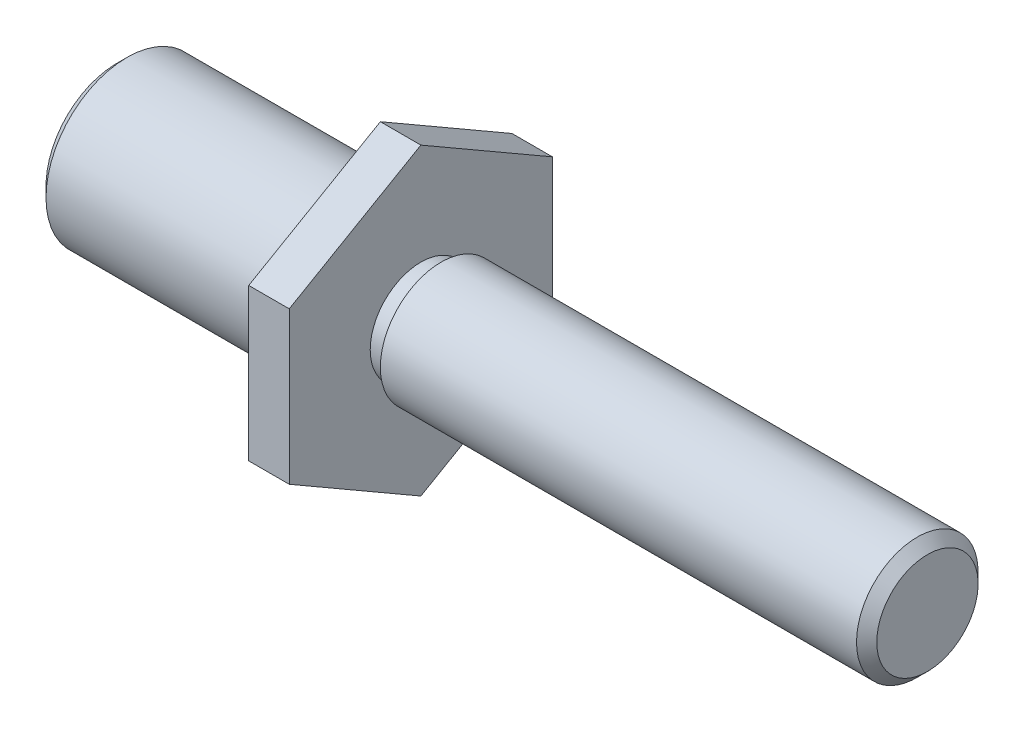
ISO-10303-21;
HEADER;
FILE_DESCRIPTION(('STEP AP214'),'2;1');
FILE_NAME('part.step','',(''),(''),'','','');
FILE_SCHEMA(('AUTOMOTIVE_DESIGN { 1 0 10303 214 1 1 1 1 }'));
ENDSEC;
DATA;
#1=APPLICATION_CONTEXT('core data for automotive mechanical design processes');
#2=APPLICATION_PROTOCOL_DEFINITION('international standard','automotive_design',2000,#1);
#3=PRODUCT_CONTEXT('',#1,'mechanical');
#4=PRODUCT('Part','Part','',(#3));
#5=PRODUCT_RELATED_PRODUCT_CATEGORY('part','',(#4));
#6=PRODUCT_DEFINITION_FORMATION('','',#4);
#7=PRODUCT_DEFINITION_CONTEXT('part definition',#1,'design');
#8=PRODUCT_DEFINITION('design','',#6,#7);
#9=PRODUCT_DEFINITION_SHAPE('','',#8);
#10=(LENGTH_UNIT() NAMED_UNIT(*) SI_UNIT(.MILLI.,.METRE.));
#11=(NAMED_UNIT(*) PLANE_ANGLE_UNIT() SI_UNIT($,.RADIAN.));
#12=(NAMED_UNIT(*) SI_UNIT($,.STERADIAN.) SOLID_ANGLE_UNIT());
#13=UNCERTAINTY_MEASURE_WITH_UNIT(LENGTH_MEASURE(1.E-05),#10,'distance_accuracy_value','');
#14=(GEOMETRIC_REPRESENTATION_CONTEXT(3) GLOBAL_UNCERTAINTY_ASSIGNED_CONTEXT((#13)) GLOBAL_UNIT_ASSIGNED_CONTEXT((#10,
#11,#12)) REPRESENTATION_CONTEXT('',''));
#15=CARTESIAN_POINT('',(0.,0.,0.));
#16=DIRECTION('',(0.,0.,1.));
#17=DIRECTION('',(1.,0.,0.));
#18=AXIS2_PLACEMENT_3D('',#15,#16,#17);
#19=CARTESIAN_POINT('',(0.,0.,0.));
#20=DIRECTION('',(1.,0.,0.));
#21=DIRECTION('',(0.,0.,-1.));
#22=AXIS2_PLACEMENT_3D('',#19,#20,#21);
#23=PLANE('',#22);
#24=CARTESIAN_POINT('',(0.,0.,0.));
#25=DIRECTION('',(1.,0.,0.));
#26=DIRECTION('',(0.,0.,-1.));
#27=AXIS2_PLACEMENT_3D('',#24,#25,#26);
#28=CIRCLE('',#27,3.49999999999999);
#29=CARTESIAN_POINT('',(0.,0.,-3.49999999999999));
#30=VERTEX_POINT('',#29);
#31=EDGE_CURVE('E163',#30,#30,#28,.F.);
#32=ORIENTED_EDGE('',*,*,#31,.T.);
#33=EDGE_LOOP('',(#32));
#34=FACE_BOUND('',#33,.T.);
#35=ADVANCED_FACE('F38',(#34),#23,.F.);
#36=CARTESIAN_POINT('',(0.,0.,0.));
#37=DIRECTION('',(-1.,0.,0.));
#38=DIRECTION('',(0.,0.,1.));
#39=AXIS2_PLACEMENT_3D('',#36,#37,#38);
#40=CYLINDRICAL_SURFACE('',#39,4.);
#41=CARTESIAN_POINT('',(0.500000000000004,0.,0.));
#42=DIRECTION('',(1.,0.,0.));
#43=DIRECTION('',(0.,0.,-1.));
#44=AXIS2_PLACEMENT_3D('',#41,#42,#43);
#45=CIRCLE('',#44,4.);
#46=CARTESIAN_POINT('',(0.500000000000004,0.,-4.));
#47=VERTEX_POINT('',#46);
#48=EDGE_CURVE('E166',#47,#47,#45,.T.);
#49=ORIENTED_EDGE('',*,*,#48,.T.);
#50=EDGE_LOOP('',(#49));
#51=FACE_BOUND('',#50,.T.);
#52=CARTESIAN_POINT('',(12.,0.,0.));
#53=DIRECTION('',(-1.,0.,0.));
#54=DIRECTION('',(0.,0.,1.));
#55=AXIS2_PLACEMENT_3D('',#52,#53,#54);
#56=CIRCLE('',#55,4.);
#57=CARTESIAN_POINT('',(12.,0.,4.));
#58=VERTEX_POINT('',#57);
#59=EDGE_CURVE('E160',#58,#58,#56,.T.);
#60=ORIENTED_EDGE('',*,*,#59,.T.);
#61=EDGE_LOOP('',(#60));
#62=FACE_BOUND('',#61,.T.);
#63=ADVANCED_FACE('F198',(#51,#62),#40,.T.);
#64=CARTESIAN_POINT('',(12.,4.,0.));
#65=DIRECTION('',(-1.,0.,0.));
#66=DIRECTION('',(0.,0.,1.));
#67=AXIS2_PLACEMENT_3D('',#64,#65,#66);
#68=PLANE('',#67);
#69=ORIENTED_EDGE('',*,*,#59,.F.);
#70=EDGE_LOOP('',(#69));
#71=FACE_BOUND('',#70,.T.);
#72=CARTESIAN_POINT('',(12.,0.,0.));
#73=DIRECTION('',(-1.,0.,0.));
#74=DIRECTION('',(0.,0.,1.));
#75=AXIS2_PLACEMENT_3D('',#72,#73,#74);
#76=CIRCLE('',#75,3.5);
#77=CARTESIAN_POINT('',(12.,0.,3.5));
#78=VERTEX_POINT('',#77);
#79=EDGE_CURVE('E157',#78,#78,#76,.T.);
#80=ORIENTED_EDGE('',*,*,#79,.T.);
#81=EDGE_LOOP('',(#80));
#82=FACE_BOUND('',#81,.T.);
#83=ADVANCED_FACE('F204',(#71,#82),#68,.F.);
#84=CARTESIAN_POINT('',(0.,0.,0.));
#85=DIRECTION('',(-1.,0.,0.));
#86=DIRECTION('',(0.,0.,1.));
#87=AXIS2_PLACEMENT_3D('',#84,#85,#86);
#88=CYLINDRICAL_SURFACE('',#87,3.5);
#89=ORIENTED_EDGE('',*,*,#79,.F.);
#90=EDGE_LOOP('',(#89));
#91=FACE_BOUND('',#90,.T.);
#92=CARTESIAN_POINT('',(13.,0.,0.));
#93=DIRECTION('',(-1.,0.,0.));
#94=DIRECTION('',(0.,0.,1.));
#95=AXIS2_PLACEMENT_3D('',#92,#93,#94);
#96=CIRCLE('',#95,3.5);
#97=CARTESIAN_POINT('',(13.,0.,3.5));
#98=VERTEX_POINT('',#97);
#99=EDGE_CURVE('E154',#98,#98,#96,.T.);
#100=ORIENTED_EDGE('',*,*,#99,.T.);
#101=EDGE_LOOP('',(#100));
#102=FACE_BOUND('',#101,.T.);
#103=ADVANCED_FACE('F217',(#91,#102),#88,.T.);
#104=CARTESIAN_POINT('',(13.,3.5,0.));
#105=DIRECTION('',(1.,0.,0.));
#106=DIRECTION('',(0.,0.,-1.));
#107=AXIS2_PLACEMENT_3D('',#104,#105,#106);
#108=PLANE('',#107);
#109=ORIENTED_EDGE('',*,*,#99,.F.);
#110=EDGE_LOOP('',(#109));
#111=FACE_BOUND('',#110,.T.);
#112=DIRECTION('',(0.,1.,0.));
#113=VECTOR('',#112,1.);
#114=CARTESIAN_POINT('',(13.,3.5,6.49519052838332));
#115=LINE('',#114,#113);
#116=CARTESIAN_POINT('',(13.,-3.74999999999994,6.49519052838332));
#117=VERTEX_POINT('',#116);
#118=CARTESIAN_POINT('',(13.,3.74999999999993,6.49519052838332));
#119=VERTEX_POINT('',#118);
#120=EDGE_CURVE('E142',#117,#119,#115,.T.);
#121=ORIENTED_EDGE('',*,*,#120,.T.);
#122=DIRECTION('',(0.,0.500000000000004,-0.866025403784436));
#123=VECTOR('',#122,1.);
#124=CARTESIAN_POINT('',(13.,6.49999999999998,1.73205080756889));
#125=LINE('',#124,#123);
#126=CARTESIAN_POINT('',(13.,7.5,0.));
#127=VERTEX_POINT('',#126);
#128=EDGE_CURVE('E127',#119,#127,#125,.T.);
#129=ORIENTED_EDGE('',*,*,#128,.T.);
#130=DIRECTION('',(0.,-0.500000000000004,-0.866025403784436));
#131=VECTOR('',#130,1.);
#132=CARTESIAN_POINT('',(13.,6.49999999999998,-1.73205080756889));
#133=LINE('',#132,#131);
#134=CARTESIAN_POINT('',(13.,3.74999999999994,-6.49519052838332));
#135=VERTEX_POINT('',#134);
#136=EDGE_CURVE('E128',#127,#135,#133,.T.);
#137=ORIENTED_EDGE('',*,*,#136,.T.);
#138=DIRECTION('',(0.,-1.,0.));
#139=VECTOR('',#138,1.);
#140=CARTESIAN_POINT('',(13.,3.5,-6.49519052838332));
#141=LINE('',#140,#139);
#142=CARTESIAN_POINT('',(13.,-3.74999999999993,-6.49519052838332));
#143=VERTEX_POINT('',#142);
#144=EDGE_CURVE('E100',#135,#143,#141,.T.);
#145=ORIENTED_EDGE('',*,*,#144,.T.);
#146=DIRECTION('',(0.,-0.500000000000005,0.866025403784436));
#147=VECTOR('',#146,1.);
#148=CARTESIAN_POINT('',(13.,-4.74999999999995,-4.76313972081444));
#149=LINE('',#148,#147);
#150=CARTESIAN_POINT('',(13.,-7.5,0.));
#151=VERTEX_POINT('',#150);
#152=EDGE_CURVE('E136',#143,#151,#149,.T.);
#153=ORIENTED_EDGE('',*,*,#152,.T.);
#154=DIRECTION('',(0.,0.500000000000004,0.866025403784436));
#155=VECTOR('',#154,1.);
#156=CARTESIAN_POINT('',(13.,-4.74999999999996,4.76313972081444));
#157=LINE('',#156,#155);
#158=EDGE_CURVE('E139',#151,#117,#157,.T.);
#159=ORIENTED_EDGE('',*,*,#158,.T.);
#160=EDGE_LOOP('',(#121,#129,#137,#145,#153,#159));
#161=FACE_BOUND('',#160,.T.);
#162=ADVANCED_FACE('F210',(#111,#161),#108,.F.);
#163=CARTESIAN_POINT('',(0.,0.,0.));
#164=DIRECTION('',(1.,0.,0.));
#165=DIRECTION('',(0.,0.,-1.));
#166=AXIS2_PLACEMENT_3D('',#163,#164,#165);
#167=CONICAL_SURFACE('',#166,3.49999999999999,0.785398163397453);
#168=ORIENTED_EDGE('',*,*,#48,.F.);
#169=EDGE_LOOP('',(#168));
#170=FACE_BOUND('',#169,.T.);
#171=ORIENTED_EDGE('',*,*,#31,.F.);
#172=EDGE_LOOP('',(#171));
#173=FACE_BOUND('',#172,.T.);
#174=ADVANCED_FACE('F208',(#170,#173),#167,.T.);
#175=CARTESIAN_POINT('',(40.,7.5,0.));
#176=DIRECTION('',(0.,-0.866025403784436,-0.500000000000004));
#177=DIRECTION('',(0.,0.500000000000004,-0.866025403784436));
#178=AXIS2_PLACEMENT_3D('',#175,#176,#177);
#179=PLANE('',#178);
#180=DIRECTION('',(-1.,0.,0.));
#181=VECTOR('',#180,1.);
#182=CARTESIAN_POINT('',(40.,3.74999999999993,6.49519052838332));
#183=LINE('',#182,#181);
#184=CARTESIAN_POINT('',(15.,3.74999999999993,6.49519052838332));
#185=VERTEX_POINT('',#184);
#186=EDGE_CURVE('E120',#185,#119,#183,.T.);
#187=ORIENTED_EDGE('',*,*,#186,.F.);
#188=DIRECTION('',(0.,-0.500000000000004,0.866025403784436));
#189=VECTOR('',#188,1.);
#190=CARTESIAN_POINT('',(15.,7.5,0.));
#191=LINE('',#190,#189);
#192=CARTESIAN_POINT('',(15.,7.5,0.));
#193=VERTEX_POINT('',#192);
#194=EDGE_CURVE('E12',#193,#185,#191,.T.);
#195=ORIENTED_EDGE('',*,*,#194,.F.);
#196=DIRECTION('',(-1.,0.,0.));
#197=VECTOR('',#196,1.);
#198=CARTESIAN_POINT('',(40.,7.5,0.));
#199=LINE('',#198,#197);
#200=EDGE_CURVE('E58',#193,#127,#199,.T.);
#201=ORIENTED_EDGE('',*,*,#200,.T.);
#202=ORIENTED_EDGE('',*,*,#128,.F.);
#203=EDGE_LOOP('',(#187,#195,#201,#202));
#204=FACE_BOUND('',#203,.T.);
#205=ADVANCED_FACE('F125',(#204),#179,.F.);
#206=CARTESIAN_POINT('',(40.,3.74999999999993,6.49519052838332));
#207=DIRECTION('',(0.,0.,-1.));
#208=DIRECTION('',(0.,1.,0.));
#209=AXIS2_PLACEMENT_3D('',#206,#207,#208);
#210=PLANE('',#209);
#211=DIRECTION('',(-1.,0.,0.));
#212=VECTOR('',#211,1.);
#213=CARTESIAN_POINT('',(40.,-3.74999999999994,6.49519052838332));
#214=LINE('',#213,#212);
#215=CARTESIAN_POINT('',(15.,-3.74999999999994,6.49519052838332));
#216=VERTEX_POINT('',#215);
#217=EDGE_CURVE('E123',#216,#117,#214,.T.);
#218=ORIENTED_EDGE('',*,*,#217,.F.);
#219=DIRECTION('',(0.,-1.,0.));
#220=VECTOR('',#219,1.);
#221=CARTESIAN_POINT('',(15.,7.5,6.49519052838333));
#222=LINE('',#221,#220);
#223=EDGE_CURVE('E46',#185,#216,#222,.T.);
#224=ORIENTED_EDGE('',*,*,#223,.F.);
#225=ORIENTED_EDGE('',*,*,#186,.T.);
#226=ORIENTED_EDGE('',*,*,#120,.F.);
#227=EDGE_LOOP('',(#218,#224,#225,#226));
#228=FACE_BOUND('',#227,.T.);
#229=ADVANCED_FACE('F119',(#228),#210,.F.);
#230=CARTESIAN_POINT('',(40.,-3.74999999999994,6.49519052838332));
#231=DIRECTION('',(0.,0.866025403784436,-0.500000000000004));
#232=DIRECTION('',(0.,0.500000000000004,0.866025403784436));
#233=AXIS2_PLACEMENT_3D('',#230,#231,#232);
#234=PLANE('',#233);
#235=DIRECTION('',(-1.,0.,0.));
#236=VECTOR('',#235,1.);
#237=CARTESIAN_POINT('',(40.,-7.5,0.));
#238=LINE('',#237,#236);
#239=CARTESIAN_POINT('',(15.,-7.5,0.));
#240=VERTEX_POINT('',#239);
#241=EDGE_CURVE('E131',#240,#151,#238,.T.);
#242=ORIENTED_EDGE('',*,*,#241,.F.);
#243=DIRECTION('',(0.,-0.500000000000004,-0.866025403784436));
#244=VECTOR('',#243,1.);
#245=CARTESIAN_POINT('',(15.,-3.74999999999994,6.49519052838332));
#246=LINE('',#245,#244);
#247=EDGE_CURVE('E110',#216,#240,#246,.T.);
#248=ORIENTED_EDGE('',*,*,#247,.F.);
#249=ORIENTED_EDGE('',*,*,#217,.T.);
#250=ORIENTED_EDGE('',*,*,#158,.F.);
#251=EDGE_LOOP('',(#242,#248,#249,#250));
#252=FACE_BOUND('',#251,.T.);
#253=ADVANCED_FACE('F237',(#252),#234,.F.);
#254=CARTESIAN_POINT('',(40.,-7.5,0.));
#255=DIRECTION('',(0.,0.866025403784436,0.500000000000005));
#256=DIRECTION('',(0.,-0.500000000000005,0.866025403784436));
#257=AXIS2_PLACEMENT_3D('',#254,#255,#256);
#258=PLANE('',#257);
#259=DIRECTION('',(-1.,0.,0.));
#260=VECTOR('',#259,1.);
#261=CARTESIAN_POINT('',(40.,-3.74999999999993,-6.49519052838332));
#262=LINE('',#261,#260);
#263=CARTESIAN_POINT('',(15.,-3.74999999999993,-6.49519052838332));
#264=VERTEX_POINT('',#263);
#265=EDGE_CURVE('E102',#264,#143,#262,.T.);
#266=ORIENTED_EDGE('',*,*,#265,.F.);
#267=DIRECTION('',(0.,0.500000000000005,-0.866025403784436));
#268=VECTOR('',#267,1.);
#269=CARTESIAN_POINT('',(15.,-3.74999999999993,-6.49519052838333));
#270=LINE('',#269,#268);
#271=EDGE_CURVE('E108',#240,#264,#270,.T.);
#272=ORIENTED_EDGE('',*,*,#271,.F.);
#273=ORIENTED_EDGE('',*,*,#241,.T.);
#274=ORIENTED_EDGE('',*,*,#152,.F.);
#275=EDGE_LOOP('',(#266,#272,#273,#274));
#276=FACE_BOUND('',#275,.T.);
#277=ADVANCED_FACE('F242',(#276),#258,.F.);
#278=CARTESIAN_POINT('',(40.,-3.74999999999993,-6.49519052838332));
#279=DIRECTION('',(0.,0.,1.));
#280=DIRECTION('',(0.,-1.,0.));
#281=AXIS2_PLACEMENT_3D('',#278,#279,#280);
#282=PLANE('',#281);
#283=DIRECTION('',(-1.,0.,0.));
#284=VECTOR('',#283,1.);
#285=CARTESIAN_POINT('',(40.,3.74999999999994,-6.49519052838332));
#286=LINE('',#285,#284);
#287=CARTESIAN_POINT('',(15.,3.74999999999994,-6.49519052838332));
#288=VERTEX_POINT('',#287);
#289=EDGE_CURVE('E53',#288,#135,#286,.T.);
#290=ORIENTED_EDGE('',*,*,#289,.F.);
#291=DIRECTION('',(0.,1.,0.));
#292=VECTOR('',#291,1.);
#293=CARTESIAN_POINT('',(15.,7.5,-6.49519052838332));
#294=LINE('',#293,#292);
#295=EDGE_CURVE('E92',#264,#288,#294,.T.);
#296=ORIENTED_EDGE('',*,*,#295,.F.);
#297=ORIENTED_EDGE('',*,*,#265,.T.);
#298=ORIENTED_EDGE('',*,*,#144,.F.);
#299=EDGE_LOOP('',(#290,#296,#297,#298));
#300=FACE_BOUND('',#299,.T.);
#301=ADVANCED_FACE('F96',(#300),#282,.F.);
#302=CARTESIAN_POINT('',(40.,3.74999999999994,-6.49519052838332));
#303=DIRECTION('',(0.,-0.866025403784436,0.500000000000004));
#304=DIRECTION('',(0.,-0.500000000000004,-0.866025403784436));
#305=AXIS2_PLACEMENT_3D('',#302,#303,#304);
#306=PLANE('',#305);
#307=ORIENTED_EDGE('',*,*,#200,.F.);
#308=DIRECTION('',(0.,0.500000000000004,0.866025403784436));
#309=VECTOR('',#308,1.);
#310=CARTESIAN_POINT('',(15.,7.5,0.));
#311=LINE('',#310,#309);
#312=EDGE_CURVE('E88',#288,#193,#311,.T.);
#313=ORIENTED_EDGE('',*,*,#312,.F.);
#314=ORIENTED_EDGE('',*,*,#289,.T.);
#315=ORIENTED_EDGE('',*,*,#136,.F.);
#316=EDGE_LOOP('',(#307,#313,#314,#315));
#317=FACE_BOUND('',#316,.T.);
#318=ADVANCED_FACE('F89',(#317),#306,.F.);
#319=CARTESIAN_POINT('',(40.,3.,0.));
#320=DIRECTION('',(-1.,0.,0.));
#321=DIRECTION('',(0.,0.,1.));
#322=AXIS2_PLACEMENT_3D('',#319,#320,#321);
#323=PLANE('',#322);
#324=CARTESIAN_POINT('',(40.,0.,0.));
#325=DIRECTION('',(-1.,0.,0.));
#326=DIRECTION('',(0.,0.,1.));
#327=AXIS2_PLACEMENT_3D('',#324,#325,#326);
#328=CIRCLE('',#327,2.5);
#329=CARTESIAN_POINT('',(40.,0.,2.5));
#330=VERTEX_POINT('',#329);
#331=EDGE_CURVE('E93',#330,#330,#328,.F.);
#332=ORIENTED_EDGE('',*,*,#331,.T.);
#333=EDGE_LOOP('',(#332));
#334=FACE_BOUND('',#333,.T.);
#335=ADVANCED_FACE('F174',(#334),#323,.F.);
#336=CARTESIAN_POINT('',(39.5,0.,0.));
#337=DIRECTION('',(-1.,0.,0.));
#338=DIRECTION('',(0.,0.,1.));
#339=AXIS2_PLACEMENT_3D('',#336,#337,#338);
#340=CONICAL_SURFACE('',#339,3.,0.785398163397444);
#341=ORIENTED_EDGE('',*,*,#331,.F.);
#342=EDGE_LOOP('',(#341));
#343=FACE_BOUND('',#342,.T.);
#344=CARTESIAN_POINT('',(39.5,0.,0.));
#345=DIRECTION('',(-1.,0.,0.));
#346=DIRECTION('',(0.,0.,1.));
#347=AXIS2_PLACEMENT_3D('',#344,#345,#346);
#348=CIRCLE('',#347,3.);
#349=CARTESIAN_POINT('',(39.5,0.,3.));
#350=VERTEX_POINT('',#349);
#351=EDGE_CURVE('E169',#350,#350,#348,.T.);
#352=ORIENTED_EDGE('',*,*,#351,.F.);
#353=EDGE_LOOP('',(#352));
#354=FACE_BOUND('',#353,.T.);
#355=ADVANCED_FACE('F40',(#343,#354),#340,.T.);
#356=CARTESIAN_POINT('',(0.,0.,0.));
#357=DIRECTION('',(-1.,0.,0.));
#358=DIRECTION('',(0.,0.,1.));
#359=AXIS2_PLACEMENT_3D('',#356,#357,#358);
#360=CYLINDRICAL_SURFACE('',#359,3.);
#361=ORIENTED_EDGE('',*,*,#351,.T.);
#362=EDGE_LOOP('',(#361));
#363=FACE_BOUND('',#362,.T.);
#364=CARTESIAN_POINT('',(16.,0.,0.));
#365=DIRECTION('',(-1.,0.,0.));
#366=DIRECTION('',(0.,0.,1.));
#367=AXIS2_PLACEMENT_3D('',#364,#365,#366);
#368=CIRCLE('',#367,3.);
#369=CARTESIAN_POINT('',(16.,0.,3.));
#370=VERTEX_POINT('',#369);
#371=EDGE_CURVE('E145',#370,#370,#368,.T.);
#372=ORIENTED_EDGE('',*,*,#371,.F.);
#373=EDGE_LOOP('',(#372));
#374=FACE_BOUND('',#373,.T.);
#375=ADVANCED_FACE('F178',(#363,#374),#360,.T.);
#376=CARTESIAN_POINT('',(16.,2.5,0.));
#377=DIRECTION('',(1.,0.,0.));
#378=DIRECTION('',(0.,0.,-1.));
#379=AXIS2_PLACEMENT_3D('',#376,#377,#378);
#380=PLANE('',#379);
#381=CARTESIAN_POINT('',(16.,0.,0.));
#382=DIRECTION('',(-1.,0.,0.));
#383=DIRECTION('',(0.,0.,1.));
#384=AXIS2_PLACEMENT_3D('',#381,#382,#383);
#385=CIRCLE('',#384,2.5);
#386=CARTESIAN_POINT('',(16.,0.,2.5));
#387=VERTEX_POINT('',#386);
#388=EDGE_CURVE('E148',#387,#387,#385,.T.);
#389=ORIENTED_EDGE('',*,*,#388,.F.);
#390=EDGE_LOOP('',(#389));
#391=FACE_BOUND('',#390,.T.);
#392=ORIENTED_EDGE('',*,*,#371,.T.);
#393=EDGE_LOOP('',(#392));
#394=FACE_BOUND('',#393,.T.);
#395=ADVANCED_FACE('F183',(#391,#394),#380,.F.);
#396=CARTESIAN_POINT('',(0.,0.,0.));
#397=DIRECTION('',(-1.,0.,0.));
#398=DIRECTION('',(0.,0.,1.));
#399=AXIS2_PLACEMENT_3D('',#396,#397,#398);
#400=CYLINDRICAL_SURFACE('',#399,2.5);
#401=CARTESIAN_POINT('',(15.,0.,0.));
#402=DIRECTION('',(-1.,0.,0.));
#403=DIRECTION('',(0.,0.,1.));
#404=AXIS2_PLACEMENT_3D('',#401,#402,#403);
#405=CIRCLE('',#404,2.5);
#406=CARTESIAN_POINT('',(15.,0.,2.5));
#407=VERTEX_POINT('',#406);
#408=EDGE_CURVE('E151',#407,#407,#405,.T.);
#409=ORIENTED_EDGE('',*,*,#408,.F.);
#410=EDGE_LOOP('',(#409));
#411=FACE_BOUND('',#410,.T.);
#412=ORIENTED_EDGE('',*,*,#388,.T.);
#413=EDGE_LOOP('',(#412));
#414=FACE_BOUND('',#413,.T.);
#415=ADVANCED_FACE('F188',(#411,#414),#400,.T.);
#416=CARTESIAN_POINT('',(15.,7.5,0.));
#417=DIRECTION('',(-1.,0.,0.));
#418=DIRECTION('',(0.,0.,1.));
#419=AXIS2_PLACEMENT_3D('',#416,#417,#418);
#420=PLANE('',#419);
#421=ORIENTED_EDGE('',*,*,#312,.T.);
#422=ORIENTED_EDGE('',*,*,#194,.T.);
#423=ORIENTED_EDGE('',*,*,#223,.T.);
#424=ORIENTED_EDGE('',*,*,#247,.T.);
#425=ORIENTED_EDGE('',*,*,#271,.T.);
#426=ORIENTED_EDGE('',*,*,#295,.T.);
#427=EDGE_LOOP('',(#421,#422,#423,#424,#425,#426));
#428=FACE_BOUND('',#427,.T.);
#429=ORIENTED_EDGE('',*,*,#408,.T.);
#430=EDGE_LOOP('',(#429));
#431=FACE_BOUND('',#430,.T.);
#432=ADVANCED_FACE('F105',(#428,#431),#420,.F.);
#433=CLOSED_SHELL('',(#35,#63,#83,#103,#162,#174,#205,#229,#253,#277,#301,#318,#335,#355,#375,
#395,#415,#432));
#434=MANIFOLD_SOLID_BREP('B2',#433);
#435=ADVANCED_BREP_SHAPE_REPRESENTATION('',(#18,#434),#14);
#436=SHAPE_DEFINITION_REPRESENTATION(#9,#435);
ENDSEC;
END-ISO-10303-21;
